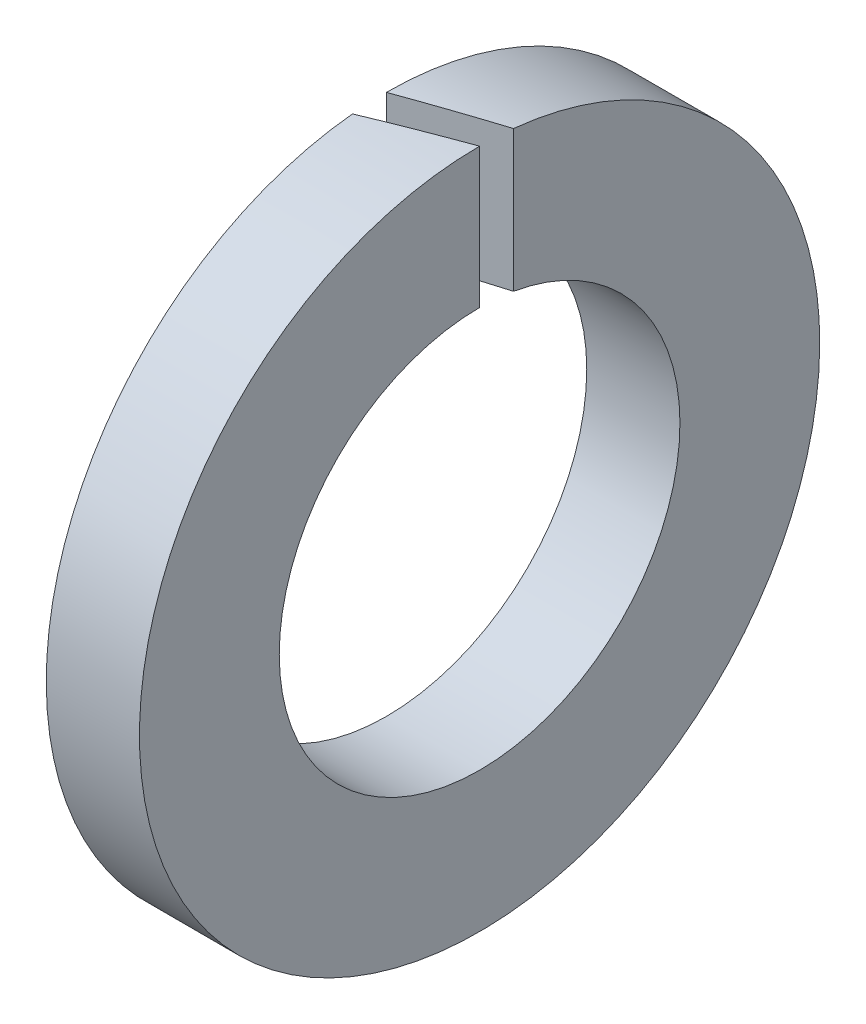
ISO-10303-21;
HEADER;
FILE_DESCRIPTION(('STEP AP214'),'2;1');
FILE_NAME('part.step','',(''),(''),'','','');
FILE_SCHEMA(('AUTOMOTIVE_DESIGN { 1 0 10303 214 1 1 1 1 }'));
ENDSEC;
DATA;
#1=APPLICATION_CONTEXT('core data for automotive mechanical design processes');
#2=APPLICATION_PROTOCOL_DEFINITION('international standard','automotive_design',2000,#1);
#3=PRODUCT_CONTEXT('',#1,'mechanical');
#4=PRODUCT('Part','Part','',(#3));
#5=PRODUCT_RELATED_PRODUCT_CATEGORY('part','',(#4));
#6=PRODUCT_DEFINITION_FORMATION('','',#4);
#7=PRODUCT_DEFINITION_CONTEXT('part definition',#1,'design');
#8=PRODUCT_DEFINITION('design','',#6,#7);
#9=PRODUCT_DEFINITION_SHAPE('','',#8);
#10=(LENGTH_UNIT() NAMED_UNIT(*) SI_UNIT(.MILLI.,.METRE.));
#11=(NAMED_UNIT(*) PLANE_ANGLE_UNIT() SI_UNIT($,.RADIAN.));
#12=(NAMED_UNIT(*) SI_UNIT($,.STERADIAN.) SOLID_ANGLE_UNIT());
#13=UNCERTAINTY_MEASURE_WITH_UNIT(LENGTH_MEASURE(1.E-05),#10,'distance_accuracy_value','');
#14=(GEOMETRIC_REPRESENTATION_CONTEXT(3) GLOBAL_UNCERTAINTY_ASSIGNED_CONTEXT((#13)) GLOBAL_UNIT_ASSIGNED_CONTEXT((#10,
#11,#12)) REPRESENTATION_CONTEXT('',''));
#15=CARTESIAN_POINT('',(0.,0.,0.));
#16=DIRECTION('',(0.,0.,1.));
#17=DIRECTION('',(1.,0.,0.));
#18=AXIS2_PLACEMENT_3D('',#15,#16,#17);
#19=CARTESIAN_POINT('',(0.,0.,-3.65));
#20=DIRECTION('',(1.,0.,0.));
#21=DIRECTION('',(0.,0.,-1.));
#22=AXIS2_PLACEMENT_3D('',#19,#20,#21);
#23=PLANE('',#22);
#24=DIRECTION('',(0.,-1.,0.));
#25=VECTOR('',#24,1.);
#26=CARTESIAN_POINT('',(0.,3.65,0.363970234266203));
#27=LINE('',#26,#25);
#28=CARTESIAN_POINT('',(0.,3.63180749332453,0.363970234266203));
#29=VERTEX_POINT('',#28);
#30=CARTESIAN_POINT('',(0.,2.1189680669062,0.363970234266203));
#31=VERTEX_POINT('',#30);
#32=EDGE_CURVE('E371',#29,#31,#27,.T.);
#33=ORIENTED_EDGE('',*,*,#32,.T.);
#34=CARTESIAN_POINT('',(0.,0.,0.));
#35=DIRECTION('',(-1.,0.,0.));
#36=DIRECTION('',(0.,0.,1.));
#37=AXIS2_PLACEMENT_3D('',#34,#35,#36);
#38=CIRCLE('',#37,2.15);
#39=CARTESIAN_POINT('',(0.,2.15,0.));
#40=VERTEX_POINT('',#39);
#41=EDGE_CURVE('E405',#40,#31,#38,.T.);
#42=ORIENTED_EDGE('',*,*,#41,.F.);
#43=DIRECTION('',(0.,-1.,0.));
#44=VECTOR('',#43,1.);
#45=CARTESIAN_POINT('',(0.,3.65,0.));
#46=LINE('',#45,#44);
#47=CARTESIAN_POINT('',(0.,3.65,0.));
#48=VERTEX_POINT('',#47);
#49=EDGE_CURVE('E414',#48,#40,#46,.T.);
#50=ORIENTED_EDGE('',*,*,#49,.F.);
#51=CARTESIAN_POINT('',(0.,0.,0.));
#52=DIRECTION('',(-1.,0.,0.));
#53=DIRECTION('',(0.,0.,1.));
#54=AXIS2_PLACEMENT_3D('',#51,#52,#53);
#55=CIRCLE('',#54,3.65);
#56=EDGE_CURVE('E403',#48,#29,#55,.T.);
#57=ORIENTED_EDGE('',*,*,#56,.T.);
#58=EDGE_LOOP('',(#33,#42,#50,#57));
#59=FACE_BOUND('',#58,.T.);
#60=ADVANCED_FACE('F350',(#59),#23,.F.);
#61=CARTESIAN_POINT('',(0.,0.,0.));
#62=DIRECTION('',(-1.,0.,0.));
#63=DIRECTION('',(0.,0.,1.));
#64=AXIS2_PLACEMENT_3D('',#61,#62,#63);
#65=CYLINDRICAL_SURFACE('',#64,2.15);
#66=CARTESIAN_POINT('',(1.,0.,0.));
#67=DIRECTION('',(-0.34202014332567,0.,-0.939692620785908));
#68=DIRECTION('',(-0.939692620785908,0.,0.34202014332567));
#69=AXIS2_PLACEMENT_3D('',#66,#67,#68);
#70=ELLIPSE('',#69,6.28617946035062,2.15);
#71=CARTESIAN_POINT('',(1.,2.15,0.));
#72=VERTEX_POINT('',#71);
#73=EDGE_CURVE('E407',#72,#31,#70,.F.);
#74=ORIENTED_EDGE('',*,*,#73,.F.);
#75=CARTESIAN_POINT('',(1.,0.,0.));
#76=DIRECTION('',(-1.,0.,0.));
#77=DIRECTION('',(0.,0.,1.));
#78=AXIS2_PLACEMENT_3D('',#75,#76,#77);
#79=CIRCLE('',#78,2.15);
#80=CARTESIAN_POINT('',(1.,2.1189680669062,-0.363970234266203));
#81=VERTEX_POINT('',#80);
#82=EDGE_CURVE('E400',#81,#72,#79,.T.);
#83=ORIENTED_EDGE('',*,*,#82,.F.);
#84=CARTESIAN_POINT('',(0.,0.,0.));
#85=DIRECTION('',(0.342020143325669,0.,0.939692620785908));
#86=DIRECTION('',(-0.939692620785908,0.,0.342020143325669));
#87=AXIS2_PLACEMENT_3D('',#84,#85,#86);
#88=ELLIPSE('',#87,6.28617946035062,2.15);
#89=EDGE_CURVE('E422',#40,#81,#88,.F.);
#90=ORIENTED_EDGE('',*,*,#89,.F.);
#91=ORIENTED_EDGE('',*,*,#41,.T.);
#92=EDGE_LOOP('',(#74,#83,#90,#91));
#93=FACE_BOUND('',#92,.T.);
#94=ADVANCED_FACE('F424',(#93),#65,.F.);
#95=CARTESIAN_POINT('',(1.,0.,-3.65));
#96=DIRECTION('',(-1.,0.,0.));
#97=DIRECTION('',(0.,0.,1.));
#98=AXIS2_PLACEMENT_3D('',#95,#96,#97);
#99=PLANE('',#98);
#100=DIRECTION('',(0.,-1.,0.));
#101=VECTOR('',#100,1.);
#102=CARTESIAN_POINT('',(1.,3.65,0.));
#103=LINE('',#102,#101);
#104=CARTESIAN_POINT('',(1.,3.65,0.));
#105=VERTEX_POINT('',#104);
#106=EDGE_CURVE('E388',#105,#72,#103,.T.);
#107=ORIENTED_EDGE('',*,*,#106,.F.);
#108=CARTESIAN_POINT('',(1.,0.,0.));
#109=DIRECTION('',(-1.,0.,0.));
#110=DIRECTION('',(0.,0.,1.));
#111=AXIS2_PLACEMENT_3D('',#108,#109,#110);
#112=CIRCLE('',#111,3.65);
#113=CARTESIAN_POINT('',(1.,3.63180749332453,-0.363970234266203));
#114=VERTEX_POINT('',#113);
#115=EDGE_CURVE('E398',#114,#105,#112,.T.);
#116=ORIENTED_EDGE('',*,*,#115,.F.);
#117=DIRECTION('',(0.,-1.,0.));
#118=VECTOR('',#117,1.);
#119=CARTESIAN_POINT('',(1.,3.65,-0.363970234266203));
#120=LINE('',#119,#118);
#121=EDGE_CURVE('E364',#114,#81,#120,.T.);
#122=ORIENTED_EDGE('',*,*,#121,.T.);
#123=ORIENTED_EDGE('',*,*,#82,.T.);
#124=EDGE_LOOP('',(#107,#116,#122,#123));
#125=FACE_BOUND('',#124,.T.);
#126=ADVANCED_FACE('F397',(#125),#99,.F.);
#127=CARTESIAN_POINT('',(0.,0.,0.));
#128=DIRECTION('',(-1.,0.,0.));
#129=DIRECTION('',(0.,0.,1.));
#130=AXIS2_PLACEMENT_3D('',#127,#128,#129);
#131=CYLINDRICAL_SURFACE('',#130,3.65);
#132=CARTESIAN_POINT('',(1.,0.,0.));
#133=DIRECTION('',(-0.34202014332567,0.,-0.939692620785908));
#134=DIRECTION('',(-0.939692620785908,0.,0.34202014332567));
#135=AXIS2_PLACEMENT_3D('',#132,#133,#134);
#136=ELLIPSE('',#135,10.6718860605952,3.65);
#137=EDGE_CURVE('E11',#29,#105,#136,.T.);
#138=ORIENTED_EDGE('',*,*,#137,.F.);
#139=ORIENTED_EDGE('',*,*,#56,.F.);
#140=CARTESIAN_POINT('',(0.,0.,0.));
#141=DIRECTION('',(0.342020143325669,0.,0.939692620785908));
#142=DIRECTION('',(-0.939692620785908,0.,0.342020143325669));
#143=AXIS2_PLACEMENT_3D('',#140,#141,#142);
#144=ELLIPSE('',#143,10.6718860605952,3.65);
#145=EDGE_CURVE('E357',#114,#48,#144,.T.);
#146=ORIENTED_EDGE('',*,*,#145,.F.);
#147=ORIENTED_EDGE('',*,*,#115,.T.);
#148=EDGE_LOOP('',(#138,#139,#146,#147));
#149=FACE_BOUND('',#148,.T.);
#150=ADVANCED_FACE('F402',(#149),#131,.T.);
#151=CARTESIAN_POINT('',(0.,3.65,0.));
#152=DIRECTION('',(0.342020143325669,0.,0.939692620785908));
#153=DIRECTION('',(0.939692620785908,0.,-0.342020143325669));
#154=AXIS2_PLACEMENT_3D('',#151,#152,#153);
#155=PLANE('',#154);
#156=ORIENTED_EDGE('',*,*,#89,.T.);
#157=ORIENTED_EDGE('',*,*,#121,.F.);
#158=ORIENTED_EDGE('',*,*,#145,.T.);
#159=ORIENTED_EDGE('',*,*,#49,.T.);
#160=EDGE_LOOP('',(#156,#157,#158,#159));
#161=FACE_BOUND('',#160,.T.);
#162=ADVANCED_FACE('F413',(#161),#155,.T.);
#163=CARTESIAN_POINT('',(1.,3.65,0.));
#164=DIRECTION('',(-0.34202014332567,0.,-0.939692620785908));
#165=DIRECTION('',(-0.939692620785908,0.,0.34202014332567));
#166=AXIS2_PLACEMENT_3D('',#163,#164,#165);
#167=PLANE('',#166);
#168=ORIENTED_EDGE('',*,*,#73,.T.);
#169=ORIENTED_EDGE('',*,*,#32,.F.);
#170=ORIENTED_EDGE('',*,*,#137,.T.);
#171=ORIENTED_EDGE('',*,*,#106,.T.);
#172=EDGE_LOOP('',(#168,#169,#170,#171));
#173=FACE_BOUND('',#172,.T.);
#174=ADVANCED_FACE('F387',(#173),#167,.T.);
#175=CLOSED_SHELL('',(#60,#94,#126,#150,#162,#174));
#176=MANIFOLD_SOLID_BREP('B2',#175);
#177=ADVANCED_BREP_SHAPE_REPRESENTATION('',(#18,#176),#14);
#178=SHAPE_DEFINITION_REPRESENTATION(#9,#177);
ENDSEC;
END-ISO-10303-21;
